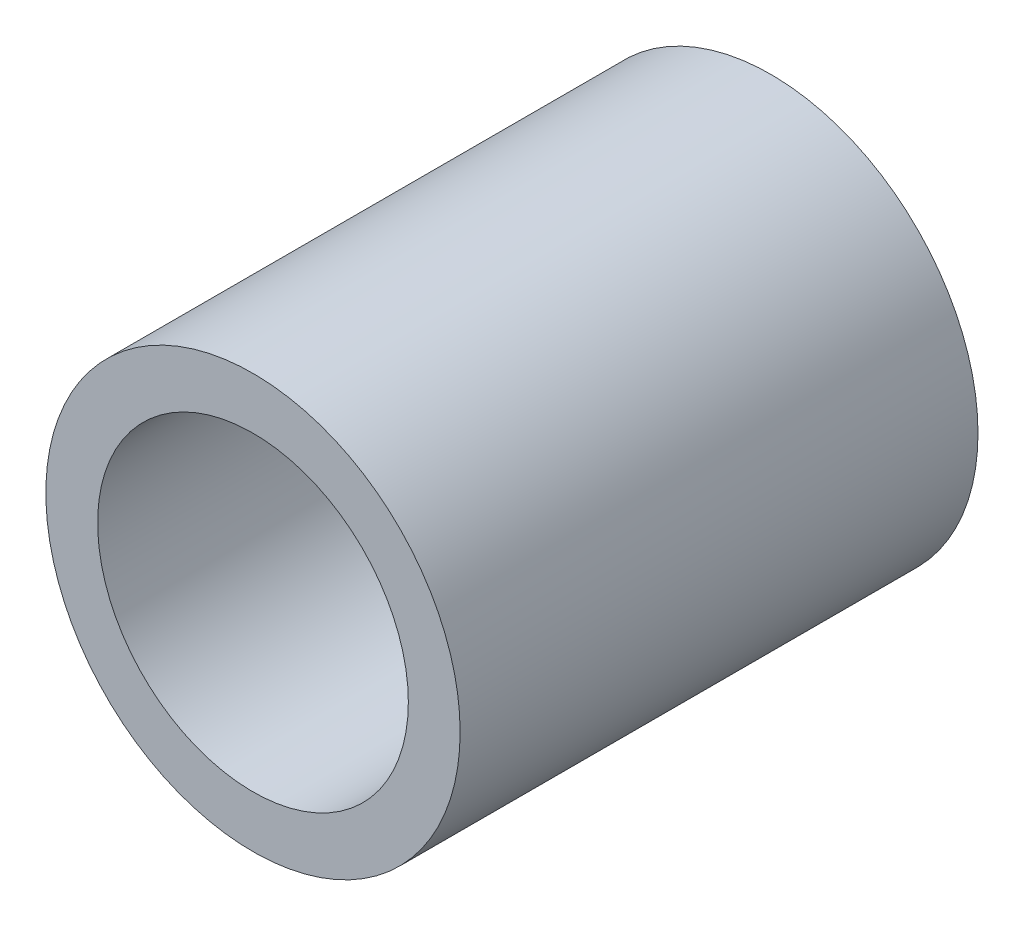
from build123d import *

# Parameters (mm, degrees)
ESQUISSE1_R      = 2
ESQUISSE1_R_2    = 1.5
EXTRUSION1_DEPTH = 2.5


with BuildPart() as part:
    # Esquisse1 → Extrusion1 (new, symmetric)
    with BuildSketch(Plane.XY):
        Circle(ESQUISSE1_R)
        Circle(ESQUISSE1_R_2, mode=Mode.SUBTRACT)
    extrude(amount=EXTRUSION1_DEPTH, both=True)


solid = part.part
